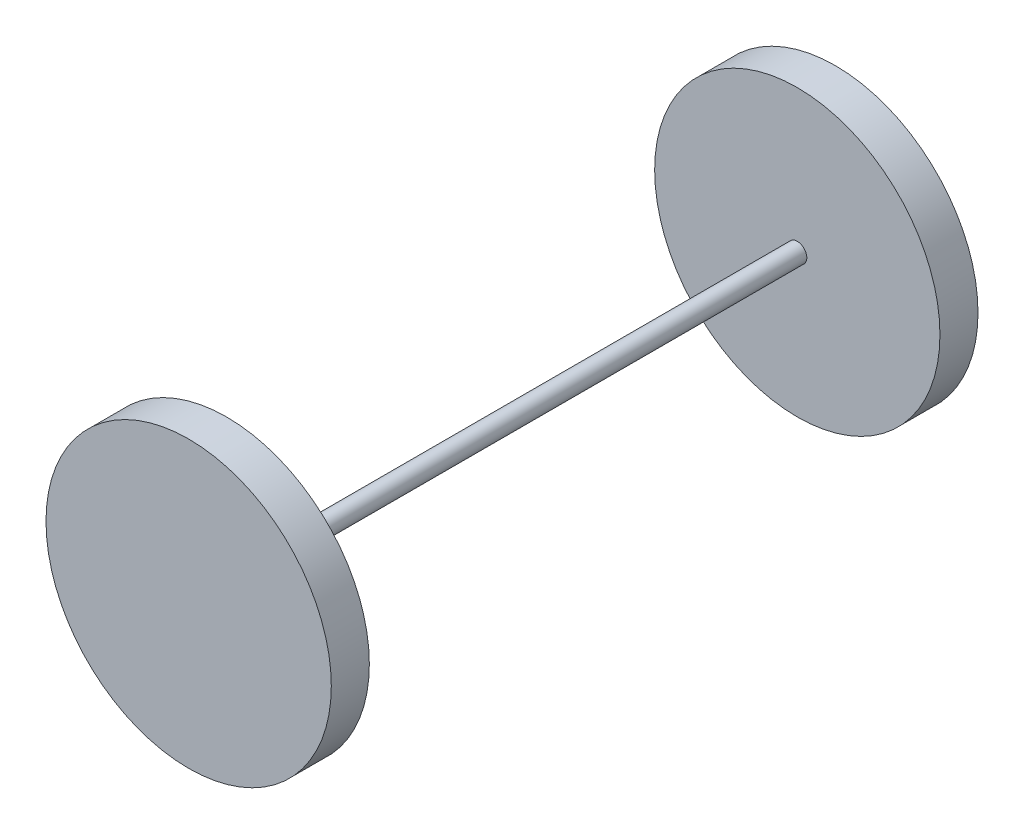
from build123d import *

# Parameters (mm, degrees)
ESQUISSE1_R      = 75
EXTRUSION1_DEPTH = 20
ESQUISSE2_R      = 5
EXTRUSION2_DEPTH = 300
ESQUISSE3_R      = 75
EXTRUSION3_DEPTH = 20


with BuildPart() as part:
    # Esquisse1 → Extrusion1 (new body)
    with BuildSketch(Plane.XY):
        Circle(ESQUISSE1_R)
    extrude(amount=EXTRUSION1_DEPTH)

    # Esquisse2 → Extrusion2 (add)
    with BuildSketch(Plane.XY.offset(20)):
        Circle(ESQUISSE2_R)
    extrude(amount=EXTRUSION2_DEPTH)

    # Esquisse3 → Extrusion3 (add)
    with BuildSketch(Plane.XY.offset(320)):
        Circle(ESQUISSE3_R)
    extrude(amount=EXTRUSION3_DEPTH)


solid = part.part
